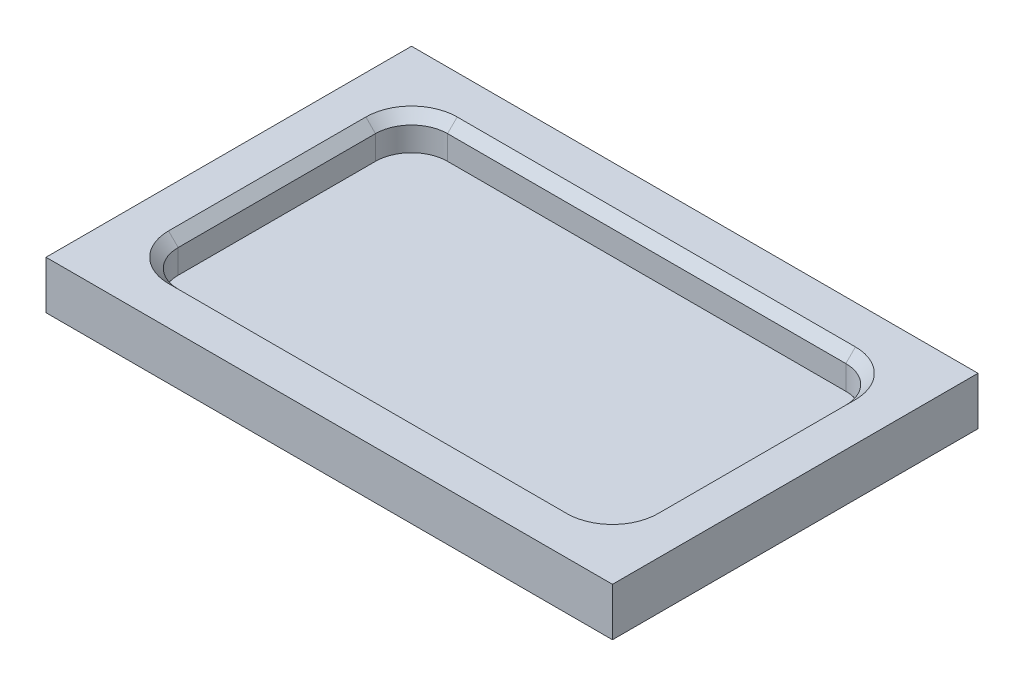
from build123d import *

# Parameters (mm, degrees)
SKETCH1_W          = 149.689969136
SKETCH1_H          = 96.588940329
EXTRUDE1_DEPTH     = 12.7
SKETCH2_W          = 124.289969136
SKETCH2_H          = 71.188940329
CUT_EXTRUDE1_DEPTH = 8.89
FILLET1_R          = 9.525
CHAMFER1_SIZE      = 2.54


with BuildPart() as part:
    # Sketch1 → Extrude1 (new body)
    with BuildSketch(Plane(origin=(0, 0, 0), x_dir=(1, 0, 0), z_dir=(0, 1, 0))):
        with Locations((12.130838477, -3.891023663)):
            Rectangle(SKETCH1_W, SKETCH1_H)
    extrude(amount=EXTRUDE1_DEPTH)

    # Sketch2 → Cut-Extrude1 (cut)
    with BuildSketch(Plane(origin=(0, 12.7, 0), x_dir=(-1, 0, 0), z_dir=(0, 1, 0))):
        with Locations((-12.130838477, 3.891023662)):
            Rectangle(SKETCH2_W, SKETCH2_H)
    extrude(amount=-CUT_EXTRUDE1_DEPTH, mode=Mode.SUBTRACT)

    # Fillet1
    fillet1_edges = [part.edges().sort_by_distance(p)[0] for p in [
        (-50.014146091, 8.255, 39.485493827),
        (-50.014146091, 8.255, -31.703446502),
        (74.275823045, 8.255, -31.703446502),
        (74.275823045, 8.255, 39.485493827),
    ]]
    fillet(fillet1_edges, radius=FILLET1_R)

    # Chamfer1
    chamfer1_edges = [part.edges().sort_by_distance(p)[0] for p in [
        (12.130838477, 12.7, -31.703446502),
        (74.275823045, 12.7, 3.891023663),
        (12.130838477, 12.7, 39.485493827),
        (-50.014146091, 12.7, 3.891023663),
        (71.486015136, 12.7, -28.913638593),
        (71.486015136, 12.7, 36.695685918),
        (-47.224338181, 12.7, 36.695685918),
        (-47.224338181, 12.7, -28.913638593),
    ]]
    chamfer(chamfer1_edges, length=CHAMFER1_SIZE)


solid = part.part
